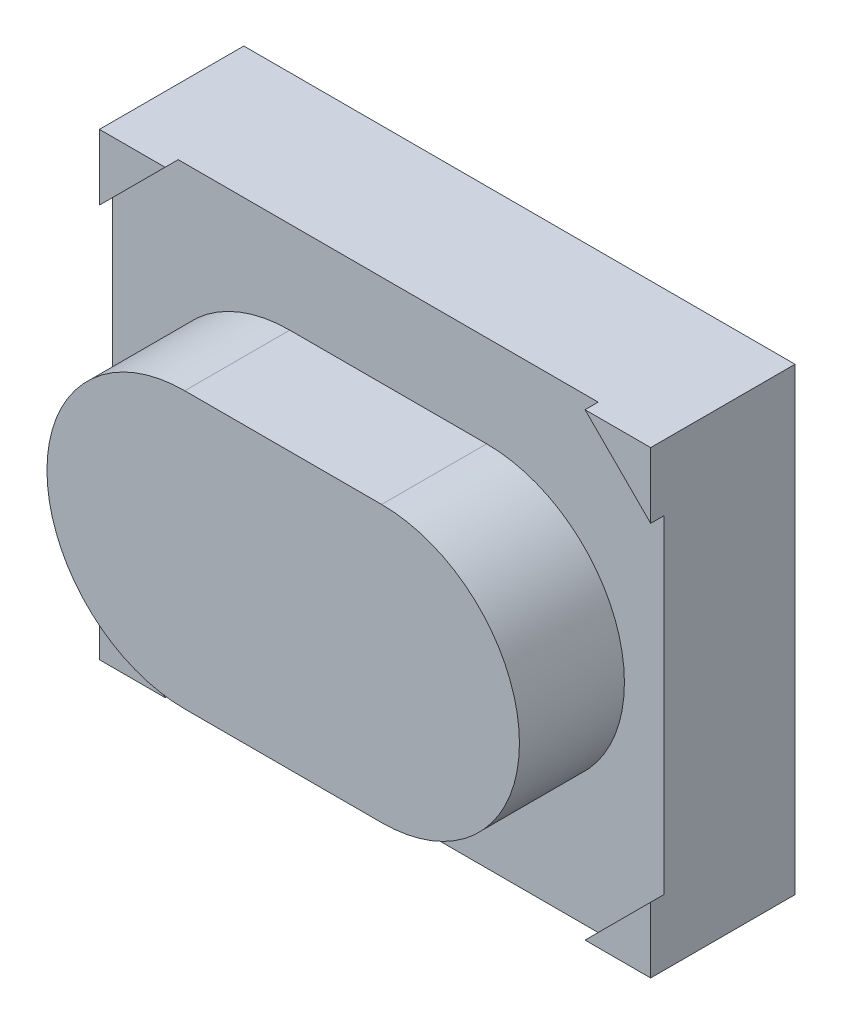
ISO-10303-21;
HEADER;
FILE_DESCRIPTION(('STEP AP214'),'2;1');
FILE_NAME('part.step','',(''),(''),'','','');
FILE_SCHEMA(('AUTOMOTIVE_DESIGN { 1 0 10303 214 1 1 1 1 }'));
ENDSEC;
DATA;
#1=APPLICATION_CONTEXT('core data for automotive mechanical design processes');
#2=APPLICATION_PROTOCOL_DEFINITION('international standard','automotive_design',2000,#1);
#3=PRODUCT_CONTEXT('',#1,'mechanical');
#4=PRODUCT('Part','Part','',(#3));
#5=PRODUCT_RELATED_PRODUCT_CATEGORY('part','',(#4));
#6=PRODUCT_DEFINITION_FORMATION('','',#4);
#7=PRODUCT_DEFINITION_CONTEXT('part definition',#1,'design');
#8=PRODUCT_DEFINITION('design','',#6,#7);
#9=PRODUCT_DEFINITION_SHAPE('','',#8);
#10=(LENGTH_UNIT() NAMED_UNIT(*) SI_UNIT(.MILLI.,.METRE.));
#11=(NAMED_UNIT(*) PLANE_ANGLE_UNIT() SI_UNIT($,.RADIAN.));
#12=(NAMED_UNIT(*) SI_UNIT($,.STERADIAN.) SOLID_ANGLE_UNIT());
#13=UNCERTAINTY_MEASURE_WITH_UNIT(LENGTH_MEASURE(1.E-05),#10,'distance_accuracy_value','');
#14=(GEOMETRIC_REPRESENTATION_CONTEXT(3) GLOBAL_UNCERTAINTY_ASSIGNED_CONTEXT((#13)) GLOBAL_UNIT_ASSIGNED_CONTEXT((#10,
#11,#12)) REPRESENTATION_CONTEXT('',''));
#15=CARTESIAN_POINT('',(0.,0.,0.));
#16=DIRECTION('',(0.,0.,1.));
#17=DIRECTION('',(1.,0.,0.));
#18=AXIS2_PLACEMENT_3D('',#15,#16,#17);
#19=CARTESIAN_POINT('',(0.,0.,1.));
#20=DIRECTION('',(0.,0.,1.));
#21=DIRECTION('',(1.,0.,0.));
#22=AXIS2_PLACEMENT_3D('',#19,#20,#21);
#23=PLANE('',#22);
#24=DIRECTION('',(0.,-1.,0.));
#25=VECTOR('',#24,1.);
#26=CARTESIAN_POINT('',(-2.1,-1.75,1.));
#27=LINE('',#26,#25);
#28=CARTESIAN_POINT('',(-2.1,1.25,1.));
#29=VERTEX_POINT('',#28);
#30=CARTESIAN_POINT('',(-2.1,-1.25,1.));
#31=VERTEX_POINT('',#30);
#32=EDGE_CURVE('E57',#29,#31,#27,.T.);
#33=ORIENTED_EDGE('',*,*,#32,.T.);
#34=DIRECTION('',(-0.707106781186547,0.707106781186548,0.));
#35=VECTOR('',#34,1.);
#36=CARTESIAN_POINT('',(-1.6,-1.75,1.));
#37=LINE('',#36,#35);
#38=CARTESIAN_POINT('',(-1.6,-1.75,1.));
#39=VERTEX_POINT('',#38);
#40=EDGE_CURVE('E173',#39,#31,#37,.T.);
#41=ORIENTED_EDGE('',*,*,#40,.F.);
#42=DIRECTION('',(1.,0.,0.));
#43=VECTOR('',#42,1.);
#44=CARTESIAN_POINT('',(2.1,-1.75,1.));
#45=LINE('',#44,#43);
#46=CARTESIAN_POINT('',(1.6,-1.75,1.));
#47=VERTEX_POINT('',#46);
#48=EDGE_CURVE('E246',#39,#47,#45,.T.);
#49=ORIENTED_EDGE('',*,*,#48,.T.);
#50=DIRECTION('',(-0.707106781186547,-0.707106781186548,0.));
#51=VECTOR('',#50,1.);
#52=CARTESIAN_POINT('',(1.6,-1.75,1.));
#53=LINE('',#52,#51);
#54=CARTESIAN_POINT('',(2.1,-1.25,1.));
#55=VERTEX_POINT('',#54);
#56=EDGE_CURVE('E193',#55,#47,#53,.T.);
#57=ORIENTED_EDGE('',*,*,#56,.F.);
#58=DIRECTION('',(0.,1.,0.));
#59=VECTOR('',#58,1.);
#60=CARTESIAN_POINT('',(2.1,-1.75,1.));
#61=LINE('',#60,#59);
#62=CARTESIAN_POINT('',(2.1,1.25,1.));
#63=VERTEX_POINT('',#62);
#64=EDGE_CURVE('E249',#55,#63,#61,.T.);
#65=ORIENTED_EDGE('',*,*,#64,.T.);
#66=DIRECTION('',(0.707106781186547,-0.707106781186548,0.));
#67=VECTOR('',#66,1.);
#68=CARTESIAN_POINT('',(1.6,1.75,1.));
#69=LINE('',#68,#67);
#70=CARTESIAN_POINT('',(1.6,1.75,1.));
#71=VERTEX_POINT('',#70);
#72=EDGE_CURVE('E210',#71,#63,#69,.T.);
#73=ORIENTED_EDGE('',*,*,#72,.F.);
#74=DIRECTION('',(-1.,0.,0.));
#75=VECTOR('',#74,1.);
#76=CARTESIAN_POINT('',(2.1,1.75,1.));
#77=LINE('',#76,#75);
#78=CARTESIAN_POINT('',(-1.6,1.75,1.));
#79=VERTEX_POINT('',#78);
#80=EDGE_CURVE('E251',#71,#79,#77,.T.);
#81=ORIENTED_EDGE('',*,*,#80,.T.);
#82=DIRECTION('',(0.707106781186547,0.707106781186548,0.));
#83=VECTOR('',#82,1.);
#84=CARTESIAN_POINT('',(-1.6,1.75,1.));
#85=LINE('',#84,#83);
#86=EDGE_CURVE('E227',#29,#79,#85,.T.);
#87=ORIENTED_EDGE('',*,*,#86,.F.);
#88=EDGE_LOOP('',(#33,#41,#49,#57,#65,#73,#81,#87));
#89=FACE_BOUND('',#88,.T.);
#90=DIRECTION('',(1.,0.,0.));
#91=VECTOR('',#90,1.);
#92=CARTESIAN_POINT('',(-0.75,-1.05,1.));
#93=LINE('',#92,#91);
#94=CARTESIAN_POINT('',(-0.75,-1.05,1.));
#95=VERTEX_POINT('',#94);
#96=CARTESIAN_POINT('',(0.75,-1.05,1.));
#97=VERTEX_POINT('',#96);
#98=EDGE_CURVE('E455',#95,#97,#93,.T.);
#99=ORIENTED_EDGE('',*,*,#98,.F.);
#100=CARTESIAN_POINT('',(-0.75,0.,1.));
#101=DIRECTION('',(0.,0.,1.));
#102=DIRECTION('',(1.,0.,0.));
#103=AXIS2_PLACEMENT_3D('',#100,#101,#102);
#104=CIRCLE('',#103,1.05);
#105=CARTESIAN_POINT('',(-0.75,1.05,1.));
#106=VERTEX_POINT('',#105);
#107=EDGE_CURVE('E171',#106,#95,#104,.T.);
#108=ORIENTED_EDGE('',*,*,#107,.F.);
#109=DIRECTION('',(-1.,0.,0.));
#110=VECTOR('',#109,1.);
#111=CARTESIAN_POINT('',(-0.75,1.05,1.));
#112=LINE('',#111,#110);
#113=CARTESIAN_POINT('',(0.75,1.05,1.));
#114=VERTEX_POINT('',#113);
#115=EDGE_CURVE('E167',#114,#106,#112,.T.);
#116=ORIENTED_EDGE('',*,*,#115,.F.);
#117=CARTESIAN_POINT('',(0.75,0.,1.));
#118=DIRECTION('',(0.,0.,1.));
#119=DIRECTION('',(1.,0.,0.));
#120=AXIS2_PLACEMENT_3D('',#117,#118,#119);
#121=CIRCLE('',#120,1.05);
#122=EDGE_CURVE('E452',#97,#114,#121,.T.);
#123=ORIENTED_EDGE('',*,*,#122,.F.);
#124=EDGE_LOOP('',(#99,#108,#116,#123));
#125=FACE_BOUND('',#124,.T.);
#126=ADVANCED_FACE('F34',(#89,#125),#23,.T.);
#127=CARTESIAN_POINT('',(-2.1,-1.75,1.));
#128=DIRECTION('',(1.,0.,0.));
#129=DIRECTION('',(0.,0.,-1.));
#130=AXIS2_PLACEMENT_3D('',#127,#128,#129);
#131=PLANE('',#130);
#132=DIRECTION('',(0.,-1.,0.));
#133=VECTOR('',#132,1.);
#134=CARTESIAN_POINT('',(-2.1,-1.75,0.));
#135=LINE('',#134,#133);
#136=CARTESIAN_POINT('',(-2.1,1.75,0.));
#137=VERTEX_POINT('',#136);
#138=CARTESIAN_POINT('',(-2.1,-1.75,0.));
#139=VERTEX_POINT('',#138);
#140=EDGE_CURVE('E244',#137,#139,#135,.T.);
#141=ORIENTED_EDGE('',*,*,#140,.T.);
#142=DIRECTION('',(0.,0.,-1.));
#143=VECTOR('',#142,1.);
#144=CARTESIAN_POINT('',(-2.1,-1.75,1.));
#145=LINE('',#144,#143);
#146=CARTESIAN_POINT('',(-2.1,-1.75,1.1));
#147=VERTEX_POINT('',#146);
#148=EDGE_CURVE('E11',#147,#139,#145,.T.);
#149=ORIENTED_EDGE('',*,*,#148,.F.);
#150=DIRECTION('',(0.,-1.,0.));
#151=VECTOR('',#150,1.);
#152=CARTESIAN_POINT('',(-2.1,-1.25,1.1));
#153=LINE('',#152,#151);
#154=CARTESIAN_POINT('',(-2.1,-1.25,1.1));
#155=VERTEX_POINT('',#154);
#156=EDGE_CURVE('E184',#155,#147,#153,.T.);
#157=ORIENTED_EDGE('',*,*,#156,.F.);
#158=DIRECTION('',(0.,0.,-1.));
#159=VECTOR('',#158,1.);
#160=CARTESIAN_POINT('',(-2.1,-1.25,1.1));
#161=LINE('',#160,#159);
#162=EDGE_CURVE('E186',#155,#31,#161,.T.);
#163=ORIENTED_EDGE('',*,*,#162,.T.);
#164=ORIENTED_EDGE('',*,*,#32,.F.);
#165=DIRECTION('',(0.,0.,-1.));
#166=VECTOR('',#165,1.);
#167=CARTESIAN_POINT('',(-2.1,1.25,1.1));
#168=LINE('',#167,#166);
#169=CARTESIAN_POINT('',(-2.1,1.25,1.1));
#170=VERTEX_POINT('',#169);
#171=EDGE_CURVE('E236',#170,#29,#168,.T.);
#172=ORIENTED_EDGE('',*,*,#171,.F.);
#173=DIRECTION('',(0.,-1.,0.));
#174=VECTOR('',#173,1.);
#175=CARTESIAN_POINT('',(-2.1,1.25,1.1));
#176=LINE('',#175,#174);
#177=CARTESIAN_POINT('',(-2.1,1.75,1.1));
#178=VERTEX_POINT('',#177);
#179=EDGE_CURVE('E234',#178,#170,#176,.T.);
#180=ORIENTED_EDGE('',*,*,#179,.F.);
#181=DIRECTION('',(0.,0.,-1.));
#182=VECTOR('',#181,1.);
#183=CARTESIAN_POINT('',(-2.1,1.75,1.));
#184=LINE('',#183,#182);
#185=EDGE_CURVE('E253',#178,#137,#184,.T.);
#186=ORIENTED_EDGE('',*,*,#185,.T.);
#187=EDGE_LOOP('',(#141,#149,#157,#163,#164,#172,#180,#186));
#188=FACE_BOUND('',#187,.T.);
#189=ADVANCED_FACE('F36',(#188),#131,.F.);
#190=CARTESIAN_POINT('',(2.1,-1.75,1.));
#191=DIRECTION('',(0.,1.,0.));
#192=DIRECTION('',(-1.,0.,0.));
#193=AXIS2_PLACEMENT_3D('',#190,#191,#192);
#194=PLANE('',#193);
#195=DIRECTION('',(1.,0.,0.));
#196=VECTOR('',#195,1.);
#197=CARTESIAN_POINT('',(2.1,-1.75,0.));
#198=LINE('',#197,#196);
#199=CARTESIAN_POINT('',(2.1,-1.75,0.));
#200=VERTEX_POINT('',#199);
#201=EDGE_CURVE('E256',#139,#200,#198,.T.);
#202=ORIENTED_EDGE('',*,*,#201,.T.);
#203=DIRECTION('',(0.,0.,-1.));
#204=VECTOR('',#203,1.);
#205=CARTESIAN_POINT('',(2.1,-1.75,1.));
#206=LINE('',#205,#204);
#207=CARTESIAN_POINT('',(2.1,-1.75,1.1));
#208=VERTEX_POINT('',#207);
#209=EDGE_CURVE('E42',#208,#200,#206,.T.);
#210=ORIENTED_EDGE('',*,*,#209,.F.);
#211=DIRECTION('',(1.,0.,0.));
#212=VECTOR('',#211,1.);
#213=CARTESIAN_POINT('',(2.1,-1.75,1.1));
#214=LINE('',#213,#212);
#215=CARTESIAN_POINT('',(1.6,-1.75,1.1));
#216=VERTEX_POINT('',#215);
#217=EDGE_CURVE('E197',#216,#208,#214,.T.);
#218=ORIENTED_EDGE('',*,*,#217,.F.);
#219=DIRECTION('',(0.,0.,-1.));
#220=VECTOR('',#219,1.);
#221=CARTESIAN_POINT('',(1.6,-1.75,1.1));
#222=LINE('',#221,#220);
#223=EDGE_CURVE('E207',#216,#47,#222,.T.);
#224=ORIENTED_EDGE('',*,*,#223,.T.);
#225=ORIENTED_EDGE('',*,*,#48,.F.);
#226=DIRECTION('',(0.,0.,-1.));
#227=VECTOR('',#226,1.);
#228=CARTESIAN_POINT('',(-1.6,-1.75,1.1));
#229=LINE('',#228,#227);
#230=CARTESIAN_POINT('',(-1.6,-1.75,1.1));
#231=VERTEX_POINT('',#230);
#232=EDGE_CURVE('E190',#231,#39,#229,.T.);
#233=ORIENTED_EDGE('',*,*,#232,.F.);
#234=DIRECTION('',(1.,0.,0.));
#235=VECTOR('',#234,1.);
#236=CARTESIAN_POINT('',(-2.1,-1.75,1.1));
#237=LINE('',#236,#235);
#238=EDGE_CURVE('E175',#147,#231,#237,.T.);
#239=ORIENTED_EDGE('',*,*,#238,.F.);
#240=ORIENTED_EDGE('',*,*,#148,.T.);
#241=EDGE_LOOP('',(#202,#210,#218,#224,#225,#233,#239,#240));
#242=FACE_BOUND('',#241,.T.);
#243=ADVANCED_FACE('F298',(#242),#194,.F.);
#244=CARTESIAN_POINT('',(2.1,-1.75,1.));
#245=DIRECTION('',(-1.,0.,0.));
#246=DIRECTION('',(0.,-1.,0.));
#247=AXIS2_PLACEMENT_3D('',#244,#245,#246);
#248=PLANE('',#247);
#249=DIRECTION('',(0.,1.,0.));
#250=VECTOR('',#249,1.);
#251=CARTESIAN_POINT('',(2.1,-1.75,0.));
#252=LINE('',#251,#250);
#253=CARTESIAN_POINT('',(2.1,1.75,0.));
#254=VERTEX_POINT('',#253);
#255=EDGE_CURVE('E258',#200,#254,#252,.T.);
#256=ORIENTED_EDGE('',*,*,#255,.T.);
#257=DIRECTION('',(0.,0.,-1.));
#258=VECTOR('',#257,1.);
#259=CARTESIAN_POINT('',(2.1,1.75,1.));
#260=LINE('',#259,#258);
#261=CARTESIAN_POINT('',(2.1,1.75,1.1));
#262=VERTEX_POINT('',#261);
#263=EDGE_CURVE('E263',#262,#254,#260,.T.);
#264=ORIENTED_EDGE('',*,*,#263,.F.);
#265=DIRECTION('',(0.,1.,0.));
#266=VECTOR('',#265,1.);
#267=CARTESIAN_POINT('',(2.1,1.25,1.1));
#268=LINE('',#267,#266);
#269=CARTESIAN_POINT('',(2.1,1.25,1.1));
#270=VERTEX_POINT('',#269);
#271=EDGE_CURVE('E216',#270,#262,#268,.T.);
#272=ORIENTED_EDGE('',*,*,#271,.F.);
#273=DIRECTION('',(0.,0.,-1.));
#274=VECTOR('',#273,1.);
#275=CARTESIAN_POINT('',(2.1,1.25,1.1));
#276=LINE('',#275,#274);
#277=EDGE_CURVE('E219',#270,#63,#276,.T.);
#278=ORIENTED_EDGE('',*,*,#277,.T.);
#279=ORIENTED_EDGE('',*,*,#64,.F.);
#280=DIRECTION('',(0.,0.,-1.));
#281=VECTOR('',#280,1.);
#282=CARTESIAN_POINT('',(2.1,-1.25,1.1));
#283=LINE('',#282,#281);
#284=CARTESIAN_POINT('',(2.1,-1.25,1.1));
#285=VERTEX_POINT('',#284);
#286=EDGE_CURVE('E202',#285,#55,#283,.T.);
#287=ORIENTED_EDGE('',*,*,#286,.F.);
#288=DIRECTION('',(0.,1.,0.));
#289=VECTOR('',#288,1.);
#290=CARTESIAN_POINT('',(2.1,-1.25,1.1));
#291=LINE('',#290,#289);
#292=EDGE_CURVE('E200',#208,#285,#291,.T.);
#293=ORIENTED_EDGE('',*,*,#292,.F.);
#294=ORIENTED_EDGE('',*,*,#209,.T.);
#295=EDGE_LOOP('',(#256,#264,#272,#278,#279,#287,#293,#294));
#296=FACE_BOUND('',#295,.T.);
#297=ADVANCED_FACE('F269',(#296),#248,.F.);
#298=CARTESIAN_POINT('',(2.1,1.75,1.));
#299=DIRECTION('',(0.,-1.,0.));
#300=DIRECTION('',(1.,0.,0.));
#301=AXIS2_PLACEMENT_3D('',#298,#299,#300);
#302=PLANE('',#301);
#303=DIRECTION('',(-1.,0.,0.));
#304=VECTOR('',#303,1.);
#305=CARTESIAN_POINT('',(2.1,1.75,0.));
#306=LINE('',#305,#304);
#307=EDGE_CURVE('E247',#254,#137,#306,.T.);
#308=ORIENTED_EDGE('',*,*,#307,.T.);
#309=ORIENTED_EDGE('',*,*,#185,.F.);
#310=DIRECTION('',(-1.,0.,0.));
#311=VECTOR('',#310,1.);
#312=CARTESIAN_POINT('',(-2.1,1.75,1.1));
#313=LINE('',#312,#311);
#314=CARTESIAN_POINT('',(-1.6,1.75,1.1));
#315=VERTEX_POINT('',#314);
#316=EDGE_CURVE('E231',#315,#178,#313,.T.);
#317=ORIENTED_EDGE('',*,*,#316,.F.);
#318=DIRECTION('',(0.,0.,-1.));
#319=VECTOR('',#318,1.);
#320=CARTESIAN_POINT('',(-1.6,1.75,1.1));
#321=LINE('',#320,#319);
#322=EDGE_CURVE('E241',#315,#79,#321,.T.);
#323=ORIENTED_EDGE('',*,*,#322,.T.);
#324=ORIENTED_EDGE('',*,*,#80,.F.);
#325=DIRECTION('',(0.,0.,-1.));
#326=VECTOR('',#325,1.);
#327=CARTESIAN_POINT('',(1.6,1.75,1.1));
#328=LINE('',#327,#326);
#329=CARTESIAN_POINT('',(1.6,1.75,1.1));
#330=VERTEX_POINT('',#329);
#331=EDGE_CURVE('E224',#330,#71,#328,.T.);
#332=ORIENTED_EDGE('',*,*,#331,.F.);
#333=DIRECTION('',(-1.,0.,0.));
#334=VECTOR('',#333,1.);
#335=CARTESIAN_POINT('',(2.1,1.75,1.1));
#336=LINE('',#335,#334);
#337=EDGE_CURVE('E211',#262,#330,#336,.T.);
#338=ORIENTED_EDGE('',*,*,#337,.F.);
#339=ORIENTED_EDGE('',*,*,#263,.T.);
#340=EDGE_LOOP('',(#308,#309,#317,#323,#324,#332,#338,#339));
#341=FACE_BOUND('',#340,.T.);
#342=ADVANCED_FACE('F277',(#341),#302,.F.);
#343=CARTESIAN_POINT('',(0.,0.,0.));
#344=DIRECTION('',(0.,0.,1.));
#345=DIRECTION('',(1.,0.,0.));
#346=AXIS2_PLACEMENT_3D('',#343,#344,#345);
#347=PLANE('',#346);
#348=ORIENTED_EDGE('',*,*,#140,.F.);
#349=ORIENTED_EDGE('',*,*,#307,.F.);
#350=ORIENTED_EDGE('',*,*,#255,.F.);
#351=ORIENTED_EDGE('',*,*,#201,.F.);
#352=EDGE_LOOP('',(#348,#349,#350,#351));
#353=FACE_BOUND('',#352,.T.);
#354=ADVANCED_FACE('F275',(#353),#347,.F.);
#355=CARTESIAN_POINT('',(-1.6,1.75,1.1));
#356=DIRECTION('',(-0.707106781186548,0.707106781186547,0.));
#357=DIRECTION('',(-0.707106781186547,-0.707106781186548,0.));
#358=AXIS2_PLACEMENT_3D('',#355,#356,#357);
#359=PLANE('',#358);
#360=ORIENTED_EDGE('',*,*,#86,.T.);
#361=ORIENTED_EDGE('',*,*,#322,.F.);
#362=DIRECTION('',(0.707106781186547,0.707106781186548,0.));
#363=VECTOR('',#362,1.);
#364=CARTESIAN_POINT('',(-1.6,1.75,1.1));
#365=LINE('',#364,#363);
#366=EDGE_CURVE('E228',#170,#315,#365,.T.);
#367=ORIENTED_EDGE('',*,*,#366,.F.);
#368=ORIENTED_EDGE('',*,*,#171,.T.);
#369=EDGE_LOOP('',(#360,#361,#367,#368));
#370=FACE_BOUND('',#369,.T.);
#371=ADVANCED_FACE('F289',(#370),#359,.F.);
#372=CARTESIAN_POINT('',(0.,0.,1.1));
#373=DIRECTION('',(0.,0.,-1.));
#374=DIRECTION('',(-1.,0.,0.));
#375=AXIS2_PLACEMENT_3D('',#372,#373,#374);
#376=PLANE('',#375);
#377=ORIENTED_EDGE('',*,*,#366,.T.);
#378=ORIENTED_EDGE('',*,*,#316,.T.);
#379=ORIENTED_EDGE('',*,*,#179,.T.);
#380=EDGE_LOOP('',(#377,#378,#379));
#381=FACE_BOUND('',#380,.T.);
#382=ADVANCED_FACE('F284',(#381),#376,.F.);
#383=CARTESIAN_POINT('',(1.6,1.75,1.1));
#384=DIRECTION('',(0.707106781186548,0.707106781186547,0.));
#385=DIRECTION('',(-0.707106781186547,0.707106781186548,0.));
#386=AXIS2_PLACEMENT_3D('',#383,#384,#385);
#387=PLANE('',#386);
#388=ORIENTED_EDGE('',*,*,#72,.T.);
#389=ORIENTED_EDGE('',*,*,#277,.F.);
#390=DIRECTION('',(0.707106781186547,-0.707106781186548,0.));
#391=VECTOR('',#390,1.);
#392=CARTESIAN_POINT('',(1.6,1.75,1.1));
#393=LINE('',#392,#391);
#394=EDGE_CURVE('E214',#330,#270,#393,.T.);
#395=ORIENTED_EDGE('',*,*,#394,.F.);
#396=ORIENTED_EDGE('',*,*,#331,.T.);
#397=EDGE_LOOP('',(#388,#389,#395,#396));
#398=FACE_BOUND('',#397,.T.);
#399=ADVANCED_FACE('F305',(#398),#387,.F.);
#400=CARTESIAN_POINT('',(0.,0.,1.1));
#401=DIRECTION('',(0.,0.,-1.));
#402=DIRECTION('',(-1.,0.,0.));
#403=AXIS2_PLACEMENT_3D('',#400,#401,#402);
#404=PLANE('',#403);
#405=ORIENTED_EDGE('',*,*,#337,.T.);
#406=ORIENTED_EDGE('',*,*,#394,.T.);
#407=ORIENTED_EDGE('',*,*,#271,.T.);
#408=EDGE_LOOP('',(#405,#406,#407));
#409=FACE_BOUND('',#408,.T.);
#410=ADVANCED_FACE('F307',(#409),#404,.F.);
#411=CARTESIAN_POINT('',(1.6,-1.75,1.1));
#412=DIRECTION('',(0.707106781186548,-0.707106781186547,0.));
#413=DIRECTION('',(0.707106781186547,0.707106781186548,0.));
#414=AXIS2_PLACEMENT_3D('',#411,#412,#413);
#415=PLANE('',#414);
#416=ORIENTED_EDGE('',*,*,#56,.T.);
#417=ORIENTED_EDGE('',*,*,#223,.F.);
#418=DIRECTION('',(-0.707106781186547,-0.707106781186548,0.));
#419=VECTOR('',#418,1.);
#420=CARTESIAN_POINT('',(1.6,-1.75,1.1));
#421=LINE('',#420,#419);
#422=EDGE_CURVE('E194',#285,#216,#421,.T.);
#423=ORIENTED_EDGE('',*,*,#422,.F.);
#424=ORIENTED_EDGE('',*,*,#286,.T.);
#425=EDGE_LOOP('',(#416,#417,#423,#424));
#426=FACE_BOUND('',#425,.T.);
#427=ADVANCED_FACE('F301',(#426),#415,.F.);
#428=CARTESIAN_POINT('',(0.,0.,1.1));
#429=DIRECTION('',(0.,0.,-1.));
#430=DIRECTION('',(-1.,0.,0.));
#431=AXIS2_PLACEMENT_3D('',#428,#429,#430);
#432=PLANE('',#431);
#433=ORIENTED_EDGE('',*,*,#422,.T.);
#434=ORIENTED_EDGE('',*,*,#217,.T.);
#435=ORIENTED_EDGE('',*,*,#292,.T.);
#436=EDGE_LOOP('',(#433,#434,#435));
#437=FACE_BOUND('',#436,.T.);
#438=ADVANCED_FACE('F314',(#437),#432,.F.);
#439=CARTESIAN_POINT('',(-1.6,-1.75,1.1));
#440=DIRECTION('',(-0.707106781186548,-0.707106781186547,0.));
#441=DIRECTION('',(0.707106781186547,-0.707106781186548,0.));
#442=AXIS2_PLACEMENT_3D('',#439,#440,#441);
#443=PLANE('',#442);
#444=ORIENTED_EDGE('',*,*,#40,.T.);
#445=ORIENTED_EDGE('',*,*,#162,.F.);
#446=DIRECTION('',(-0.707106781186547,0.707106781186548,0.));
#447=VECTOR('',#446,1.);
#448=CARTESIAN_POINT('',(-1.6,-1.75,1.1));
#449=LINE('',#448,#447);
#450=EDGE_CURVE('E182',#231,#155,#449,.T.);
#451=ORIENTED_EDGE('',*,*,#450,.F.);
#452=ORIENTED_EDGE('',*,*,#232,.T.);
#453=EDGE_LOOP('',(#444,#445,#451,#452));
#454=FACE_BOUND('',#453,.T.);
#455=ADVANCED_FACE('F294',(#454),#443,.F.);
#456=CARTESIAN_POINT('',(0.,0.,1.1));
#457=DIRECTION('',(0.,0.,-1.));
#458=DIRECTION('',(-1.,0.,0.));
#459=AXIS2_PLACEMENT_3D('',#456,#457,#458);
#460=PLANE('',#459);
#461=ORIENTED_EDGE('',*,*,#238,.T.);
#462=ORIENTED_EDGE('',*,*,#450,.T.);
#463=ORIENTED_EDGE('',*,*,#156,.T.);
#464=EDGE_LOOP('',(#461,#462,#463));
#465=FACE_BOUND('',#464,.T.);
#466=ADVANCED_FACE('F389',(#465),#460,.F.);
#467=CARTESIAN_POINT('',(-0.75,0.,1.8));
#468=DIRECTION('',(0.,0.,-1.));
#469=DIRECTION('',(-1.,0.,0.));
#470=AXIS2_PLACEMENT_3D('',#467,#468,#469);
#471=CYLINDRICAL_SURFACE('',#470,1.05);
#472=ORIENTED_EDGE('',*,*,#107,.T.);
#473=DIRECTION('',(0.,0.,-1.));
#474=VECTOR('',#473,1.);
#475=CARTESIAN_POINT('',(-0.75,-1.05,1.8));
#476=LINE('',#475,#474);
#477=CARTESIAN_POINT('',(-0.75,-1.05,1.8));
#478=VERTEX_POINT('',#477);
#479=EDGE_CURVE('E152',#478,#95,#476,.T.);
#480=ORIENTED_EDGE('',*,*,#479,.F.);
#481=CARTESIAN_POINT('',(-0.75,0.,1.8));
#482=DIRECTION('',(0.,0.,1.));
#483=DIRECTION('',(1.,0.,0.));
#484=AXIS2_PLACEMENT_3D('',#481,#482,#483);
#485=CIRCLE('',#484,1.05);
#486=CARTESIAN_POINT('',(-0.75,1.05,1.8));
#487=VERTEX_POINT('',#486);
#488=EDGE_CURVE('E159',#487,#478,#485,.T.);
#489=ORIENTED_EDGE('',*,*,#488,.F.);
#490=DIRECTION('',(0.,0.,-1.));
#491=VECTOR('',#490,1.);
#492=CARTESIAN_POINT('',(-0.75,1.05,1.8));
#493=LINE('',#492,#491);
#494=EDGE_CURVE('E450',#487,#106,#493,.T.);
#495=ORIENTED_EDGE('',*,*,#494,.T.);
#496=EDGE_LOOP('',(#472,#480,#489,#495));
#497=FACE_BOUND('',#496,.T.);
#498=ADVANCED_FACE('F169',(#497),#471,.T.);
#499=CARTESIAN_POINT('',(-0.75,-1.05,1.8));
#500=DIRECTION('',(0.,1.,0.));
#501=DIRECTION('',(0.,0.,1.));
#502=AXIS2_PLACEMENT_3D('',#499,#500,#501);
#503=PLANE('',#502);
#504=ORIENTED_EDGE('',*,*,#98,.T.);
#505=DIRECTION('',(0.,0.,-1.));
#506=VECTOR('',#505,1.);
#507=CARTESIAN_POINT('',(0.75,-1.05,1.8));
#508=LINE('',#507,#506);
#509=CARTESIAN_POINT('',(0.75,-1.05,1.8));
#510=VERTEX_POINT('',#509);
#511=EDGE_CURVE('E155',#510,#97,#508,.T.);
#512=ORIENTED_EDGE('',*,*,#511,.F.);
#513=DIRECTION('',(1.,0.,0.));
#514=VECTOR('',#513,1.);
#515=CARTESIAN_POINT('',(-0.75,-1.05,1.8));
#516=LINE('',#515,#514);
#517=EDGE_CURVE('E148',#478,#510,#516,.T.);
#518=ORIENTED_EDGE('',*,*,#517,.F.);
#519=ORIENTED_EDGE('',*,*,#479,.T.);
#520=EDGE_LOOP('',(#504,#512,#518,#519));
#521=FACE_BOUND('',#520,.T.);
#522=ADVANCED_FACE('F150',(#521),#503,.F.);
#523=CARTESIAN_POINT('',(0.75,0.,1.8));
#524=DIRECTION('',(0.,0.,-1.));
#525=DIRECTION('',(-1.,0.,0.));
#526=AXIS2_PLACEMENT_3D('',#523,#524,#525);
#527=CYLINDRICAL_SURFACE('',#526,1.05);
#528=ORIENTED_EDGE('',*,*,#122,.T.);
#529=DIRECTION('',(0.,0.,-1.));
#530=VECTOR('',#529,1.);
#531=CARTESIAN_POINT('',(0.75,1.05,1.8));
#532=LINE('',#531,#530);
#533=CARTESIAN_POINT('',(0.75,1.05,1.8));
#534=VERTEX_POINT('',#533);
#535=EDGE_CURVE('E49',#534,#114,#532,.T.);
#536=ORIENTED_EDGE('',*,*,#535,.F.);
#537=CARTESIAN_POINT('',(0.75,0.,1.8));
#538=DIRECTION('',(0.,0.,1.));
#539=DIRECTION('',(1.,0.,0.));
#540=AXIS2_PLACEMENT_3D('',#537,#538,#539);
#541=CIRCLE('',#540,1.05);
#542=EDGE_CURVE('E158',#510,#534,#541,.T.);
#543=ORIENTED_EDGE('',*,*,#542,.F.);
#544=ORIENTED_EDGE('',*,*,#511,.T.);
#545=EDGE_LOOP('',(#528,#536,#543,#544));
#546=FACE_BOUND('',#545,.T.);
#547=ADVANCED_FACE('F419',(#546),#527,.T.);
#548=CARTESIAN_POINT('',(-0.75,1.05,1.8));
#549=DIRECTION('',(0.,-1.,0.));
#550=DIRECTION('',(0.,0.,-1.));
#551=AXIS2_PLACEMENT_3D('',#548,#549,#550);
#552=PLANE('',#551);
#553=ORIENTED_EDGE('',*,*,#115,.T.);
#554=ORIENTED_EDGE('',*,*,#494,.F.);
#555=DIRECTION('',(-1.,0.,0.));
#556=VECTOR('',#555,1.);
#557=CARTESIAN_POINT('',(-0.75,1.05,1.8));
#558=LINE('',#557,#556);
#559=EDGE_CURVE('E163',#534,#487,#558,.T.);
#560=ORIENTED_EDGE('',*,*,#559,.F.);
#561=ORIENTED_EDGE('',*,*,#535,.T.);
#562=EDGE_LOOP('',(#553,#554,#560,#561));
#563=FACE_BOUND('',#562,.T.);
#564=ADVANCED_FACE('F428',(#563),#552,.F.);
#565=CARTESIAN_POINT('',(-0.75,0.,1.8));
#566=DIRECTION('',(0.,0.,1.));
#567=DIRECTION('',(1.,0.,0.));
#568=AXIS2_PLACEMENT_3D('',#565,#566,#567);
#569=PLANE('',#568);
#570=ORIENTED_EDGE('',*,*,#488,.T.);
#571=ORIENTED_EDGE('',*,*,#517,.T.);
#572=ORIENTED_EDGE('',*,*,#542,.T.);
#573=ORIENTED_EDGE('',*,*,#559,.T.);
#574=EDGE_LOOP('',(#570,#571,#572,#573));
#575=FACE_BOUND('',#574,.T.);
#576=ADVANCED_FACE('F162',(#575),#569,.T.);
#577=CLOSED_SHELL('',(#126,#189,#243,#297,#342,#354,#371,#382,#399,#410,#427,#438,#455,#466,
#498,#522,#547,#564,#576));
#578=MANIFOLD_SOLID_BREP('B2',#577);
#579=ADVANCED_BREP_SHAPE_REPRESENTATION('',(#18,#578),#14);
#580=SHAPE_DEFINITION_REPRESENTATION(#9,#579);
ENDSEC;
END-ISO-10303-21;
